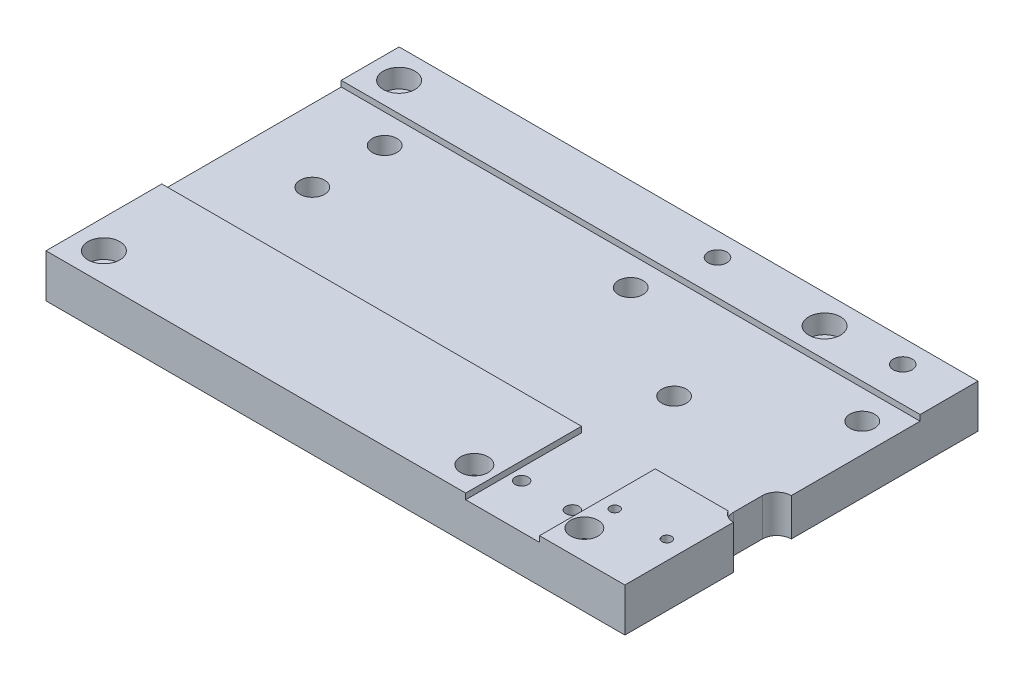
from build123d import *

# Parameters (mm, degrees)
SKETCH_1_W          = 200
SKETCH_1_H          = 15
EXTRUDE_1_DEPTH     = 122
SKETCH_2_W          = 62
SKETCH_2_H          = 10.083191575
CUT_EXTRUDE_1_DEPTH = 235.753061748
SKETCH_3_W          = 25.5
SKETCH_3_H          = 40
CUT_EXTRUDE_2_DEPTH = 2
SKETCH_4_R          = 2.25
SKETCH_4_R_2        = 4.25
SKETCH_4_R_3        = 3.25
SKETCH_4_R_4        = 2.75
SKETCH_4_R_5        = 1.65
CUT_EXTRUDE_3_DEPTH = 235.753061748
SKETCH_5_R          = 5.5
SKETCH_5_R_2        = 4.75
CUT_EXTRUDE_4_DEPTH = 6.5
SKETCH_7_R          = 7
SKETCH_7_R_2        = 5.5
SKETCH_7_R_3        = 4
CUT_EXTRUDE_5_DEPTH = 6.5


with BuildPart() as part:
    # Sketch 1 → Extrude 1 (new body)
    with BuildSketch(Plane.XY):
        with Locations((100, 7.5)):
            Rectangle(SKETCH_1_W, SKETCH_1_H)
    extrude(amount=EXTRUDE_1_DEPTH)

    # Sketch 2 → Cut-Extrude 1 (cut, through all)
    with BuildSketch(Plane(origin=(200, 0, 0), x_dir=(0, 0, -1), z_dir=(1, 0, 0))):
        with Locations((-51, 18.041595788)):
            Rectangle(SKETCH_2_W, SKETCH_2_H)
    extrude(amount=-CUT_EXTRUDE_1_DEPTH, mode=Mode.SUBTRACT)

    # Sketch 3 → Cut-Extrude 2 (cut)
    with BuildSketch(Plane(origin=(0, 15, 0), x_dir=(1, 0, 0), z_dir=(0, 1, 0))):
        with Locations((157.75, -102)):
            Rectangle(SKETCH_3_W, SKETCH_3_H)
    extrude(amount=-CUT_EXTRUDE_2_DEPTH, mode=Mode.SUBTRACT)

    # Sketch 4 → Cut-Extrude 3 (cut, through all)
    with BuildSketch(Plane(origin=(0, 15, 0), x_dir=(1, 0, 0), z_dir=(0, 1, 0))):
        with Locations(Location((166.5, -106.65, 0), (0, 0, 270))):
            Circle(SKETCH_4_R)
        with Locations(Location((149, -106.65, 0), (0, 0, 270))):
            Circle(SKETCH_4_R)
        with Locations(Location((110, -30, 0), (0, 0, 270))):
            Circle(SKETCH_4_R_2)
        with Locations(Location((190, -30, 0), (0, 0, 270))):
            Circle(SKETCH_4_R_2)
        with Locations(Location((150, -55, 0), (0, 0, 270))):
            Circle(SKETCH_4_R_2)
        with Locations(Location((118, -8, 0), (0, 0, 270))):
            Circle(SKETCH_4_R_3)
        with Locations(Location((182, -8, 0), (0, 0, 270))):
            Circle(SKETCH_4_R_3)
        with Locations(Location((25, -30, 0), (0, 0, 270))):
            Circle(SKETCH_4_R_2)
        with Locations(Location((25, -55, 0), (0, 0, 270))):
            Circle(SKETCH_4_R_2)
        with Locations(Location((157, -10, 0), (0, 0, 270))):
            Circle(SKETCH_4_R_3)
        with Locations(Location((138, -112, 0), (0, 0, 270))):
            Circle(SKETCH_4_R_4)
        with Locations(Location((176, -112, 0), (0, 0, 270))):
            Circle(SKETCH_4_R_4)
        with Locations(Location((10, -10, 0), (0, 0, 270))):
            Circle(SKETCH_4_R_3)
        with Locations(Location((10, -112, 0), (0, 0, 270))):
            Circle(SKETCH_4_R_3)
        with Locations(Location((193.5, -101, 0), (0, 0, 270))):
            Circle(SKETCH_4_R_5)
        with Locations(Location((175.5, -101, 0), (0, 0, 270))):
            Circle(SKETCH_4_R_5)
        with BuildLine():
            Line((195, -79.5), (195, -69.5))
            ThreePointArc((195, -69.5), (196.464466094, -65.964466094), (200, -64.5))
            Line((200, -64.5), (200, -84.5))
            ThreePointArc((200, -84.5), (196.464466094, -83.035533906), (195, -79.5))
        make_face()
    extrude(amount=-CUT_EXTRUDE_3_DEPTH, mode=Mode.SUBTRACT)

    # Sketch 5 → Cut-Extrude 4 (cut)
    with BuildSketch(Plane(origin=(0, 15, 0), x_dir=(1, 0, 0), z_dir=(0, 1, 0))):
        with Locations(Location((157, -10, 0), (0, 0, 270))):
            Circle(SKETCH_5_R)
        with Locations(Location((138, -112, 0), (0, 0, 270))):
            Circle(SKETCH_5_R_2)
        with Locations(Location((176, -112, 0), (0, 0, 270))):
            Circle(SKETCH_5_R_2)
        with Locations(Location((10, -10, 0), (0, 0, 270))):
            Circle(SKETCH_5_R)
        with Locations(Location((10, -112, 0), (0, 0, 270))):
            Circle(SKETCH_5_R)
    extrude(amount=-CUT_EXTRUDE_4_DEPTH, mode=Mode.SUBTRACT)

    # Sketch 7 → Cut-Extrude 5 (cut)
    with BuildSketch(Plane.XZ):
        with Locations(Location((25, 55, 0), (0, 0, 270))):
            Circle(SKETCH_7_R)
        with Locations(Location((25, 30, 0), (0, 0, 270))):
            Circle(SKETCH_7_R)
        with Locations(Location((110, 30, 0), (0, 0, 270))):
            Circle(SKETCH_7_R)
        with Locations(Location((118, 8, 0), (0, 0, 270))):
            Circle(SKETCH_7_R_2)
        with Locations(Location((150, 55, 0), (0, 0, 270))):
            Circle(SKETCH_7_R)
        with Locations(Location((190, 30, 0), (0, 0, 270))):
            Circle(SKETCH_7_R)
        with Locations(Location((182, 8, 0), (0, 0, 270))):
            Circle(SKETCH_7_R_2)
        with Locations(Location((149, 106.65, 0), (0, 0, 270))):
            Circle(SKETCH_7_R_3)
        with Locations(Location((166.5, 106.65, 0), (0, 0, 270))):
            Circle(SKETCH_7_R_3)
    extrude(amount=-CUT_EXTRUDE_5_DEPTH, mode=Mode.SUBTRACT)


solid = part.part
